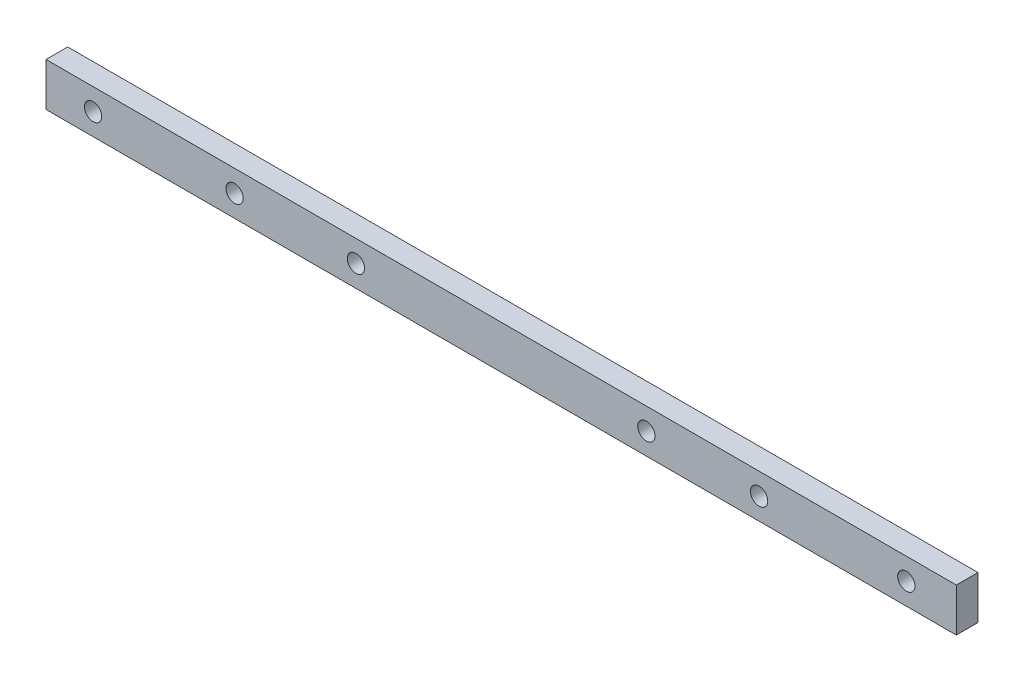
from build123d import *

# Parameters (mm, degrees)
SKETCH1_W           = 210
SKETCH1_H           = 10
BOSS_EXTRUDE1_DEPTH = 5
SKETCH2_R           = 2
CUT_EXTRUDE1_DEPTH  = 5


with BuildPart() as part:
    # Sketch1 → Boss-Extrude1 (new body)
    with BuildSketch(Plane.XY):
        Rectangle(SKETCH1_W, SKETCH1_H)
    extrude(amount=BOSS_EXTRUDE1_DEPTH)

    # Sketch2 → Cut-Extrude1 (cut)
    with BuildSketch(Plane.XY.offset(5)):
        with Locations((59.5, 0)):
            Circle(SKETCH2_R)
        with Locations((93.468, 0)):
            Circle(SKETCH2_R)
        with Locations((33.5, 0)):
            Circle(SKETCH2_R)
        with Locations((-33.5, 0)):
            Circle(SKETCH2_R)
        with Locations((-61.5, 0)):
            Circle(SKETCH2_R)
        with Locations((-94.1387178, 0)):
            Circle(SKETCH2_R)
    extrude(amount=-CUT_EXTRUDE1_DEPTH, mode=Mode.SUBTRACT)


solid = part.part
